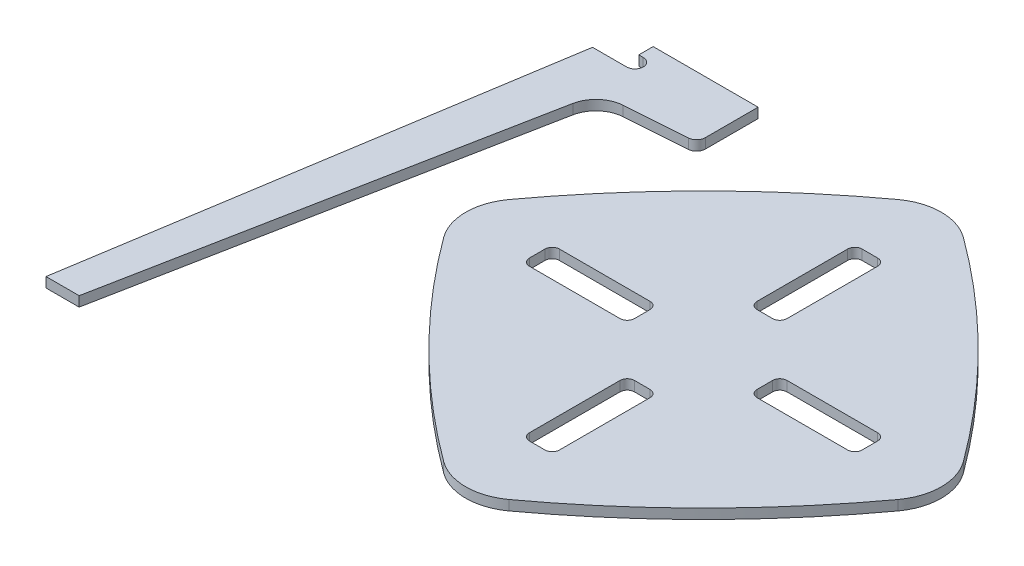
from build123d import *

# Parameters (mm, degrees)
SALIENTE_EXTRUIR1_DEPTH   = 9
SALIENTE_EXTRUIR1_2_DEPTH = 9
CUT_EXTRUDE3_DEPTH        = 78


with BuildPart() as part:
    # Croquis3 → Saliente-Extruir1 (new body)
    with BuildSketch(Plane(origin=(0, 143.125, 0), x_dir=(1, 0, 0), z_dir=(0, 1, 0))):
        with BuildLine():
            Line((-287.087527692, 186.642789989), (-354.742769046, -240.357210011))
            Line((-354.742769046, -240.357210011), (-324.742769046, -240.357210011))
            Line((-324.742769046, -240.357210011), (-252.038147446, 133.675643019))
            ThreePointArc((-252.038147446, 133.675643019), (-243.584458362, 148.466531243), (-227.873573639, 155.054651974))
            Line((-227.873573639, 155.054651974), (-172.684717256, 158.913832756))
            ThreePointArc((-172.684717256, 158.913832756), (-167.391939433, 161.438358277), (-165.242769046, 166.894345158))
            Line((-165.242769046, 166.894345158), (-165.242769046, 214.642789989))
            Line((-165.242769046, 214.642789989), (-260.242769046, 214.642789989))
            Line((-260.242769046, 214.642789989), (-260.242769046, 201.642789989))
            Line((-260.242769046, 201.642789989), (-256.242769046, 201.642789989))
            ThreePointArc((-256.242769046, 201.642789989), (-248.742769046, 194.142789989), (-256.242769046, 186.642789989))
            Line((-256.242769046, 186.642789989), (-260.242769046, 186.642789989))
            Line((-260.242769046, 186.642789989), (-287.087527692, 186.642789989))
        make_face()
    extrude(amount=SALIENTE_EXTRUIR1_DEPTH)


with BuildPart() as body_2:
    # Croquis3 → Saliente-Extruir1 2 (new body)
    with BuildSketch(Plane(origin=(0, 143.125, 0), x_dir=(1, 0, 0), z_dir=(0, 1, 0))):
        with BuildLine():
            ThreePointArc((-205.553702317, 29.580883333), (-124.281957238, 124.281957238), (-29.580883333, 205.553702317))
            ThreePointArc((-29.580883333, 205.553702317), (0, 215.242769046), (29.580883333, 205.553702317))
            ThreePointArc((29.580883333, 205.553702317), (124.281957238, 124.281957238), (205.553702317, 29.580883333))
            ThreePointArc((205.553702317, 29.580883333), (215.242769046, 0), (205.553702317, -29.580883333))
            ThreePointArc((205.553702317, -29.580883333), (124.281957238, -124.281957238), (29.580883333, -205.553702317))
            ThreePointArc((29.580883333, -205.553702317), (0, -215.242769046), (-29.580883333, -205.553702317))
            ThreePointArc((-29.580883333, -205.553702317), (-124.281957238, -124.281957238), (-205.553702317, -29.580883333))
            ThreePointArc((-205.553702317, -29.580883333), (-215.242769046, 0), (-205.553702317, 29.580883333))
        make_face()
    extrude(amount=SALIENTE_EXTRUIR1_2_DEPTH)

    # Sketch3 → Cut-Extrude3 (cut)
    with BuildSketch(Plane(origin=(0, 152.125, 0), x_dir=(1, 0, 0), z_dir=(0, 1, 0))):
        with BuildLine():
            Line((-7.05, -55.5), (7.05, -55.5))
            ThreePointArc((7.05, -55.5), (11.646194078, -57.403805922), (13.55, -62))
            Line((13.55, -62), (13.55, -144))
            ThreePointArc((13.55, -144), (11.646194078, -148.596194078), (7.05, -150.5))
            Line((7.05, -150.5), (-7.05, -150.5))
            ThreePointArc((-7.05, -150.5), (-11.646194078, -148.596194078), (-13.55, -144))
            Line((-13.55, -144), (-13.55, -62))
            ThreePointArc((-13.55, -62), (-11.646194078, -57.403805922), (-7.05, -55.5))
        make_face()
        with BuildLine():
            Line((62, -13.55), (144, -13.55))
            ThreePointArc((144, -13.55), (148.596194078, -11.646194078), (150.5, -7.05))
            Line((150.5, -7.05), (150.5, 7.05))
            ThreePointArc((150.5, 7.05), (148.596194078, 11.646194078), (144, 13.55))
            Line((144, 13.55), (62, 13.55))
            ThreePointArc((62, 13.55), (57.403805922, 11.646194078), (55.5, 7.05))
            Line((55.5, 7.05), (55.5, -7.05))
            ThreePointArc((55.5, -7.05), (57.403805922, -11.646194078), (62, -13.55))
        make_face()
        with BuildLine():
            Line((-55.5, 7.05), (-55.5, -7.05))
            ThreePointArc((-55.5, -7.05), (-57.403805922, -11.646194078), (-62, -13.55))
            Line((-62, -13.55), (-144, -13.55))
            ThreePointArc((-144, -13.55), (-148.596194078, -11.646194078), (-150.5, -7.05))
            Line((-150.5, -7.05), (-150.5, 7.05))
            ThreePointArc((-150.5, 7.05), (-148.596194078, 11.646194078), (-144, 13.55))
            Line((-144, 13.55), (-62, 13.55))
            ThreePointArc((-62, 13.55), (-57.403805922, 11.646194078), (-55.5, 7.05))
        make_face()
        with BuildLine():
            Line((7.05, 55.5), (-7.05, 55.5))
            ThreePointArc((-7.05, 55.5), (-11.646194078, 57.403805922), (-13.55, 62))
            Line((-13.55, 62), (-13.55, 144))
            ThreePointArc((-13.55, 144), (-11.646194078, 148.596194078), (-7.05, 150.5))
            Line((-7.05, 150.5), (7.05, 150.5))
            ThreePointArc((7.05, 150.5), (11.646194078, 148.596194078), (13.55, 144))
            Line((13.55, 144), (13.55, 62))
            ThreePointArc((13.55, 62), (11.646194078, 57.403805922), (7.05, 55.5))
        make_face()
    extrude(amount=-CUT_EXTRUDE3_DEPTH, mode=Mode.SUBTRACT)


solid = Compound([part.part, body_2.part])
